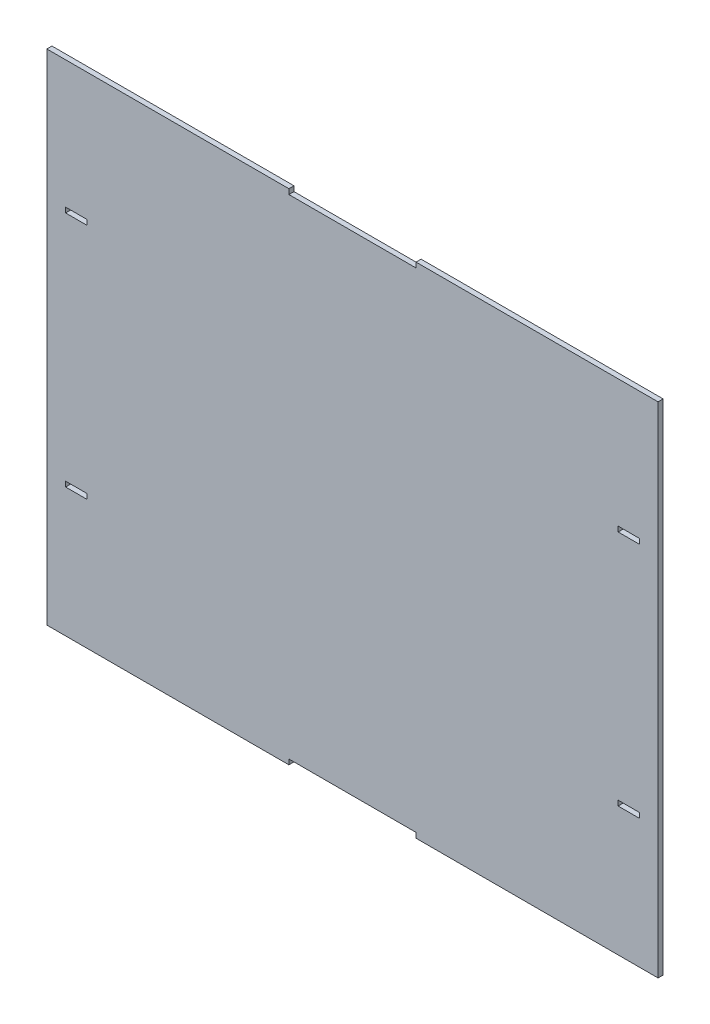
ISO-10303-21;
HEADER;
FILE_DESCRIPTION(('STEP AP214'),'2;1');
FILE_NAME('part.step','',(''),(''),'','','');
FILE_SCHEMA(('AUTOMOTIVE_DESIGN { 1 0 10303 214 1 1 1 1 }'));
ENDSEC;
DATA;
#1=APPLICATION_CONTEXT('core data for automotive mechanical design processes');
#2=APPLICATION_PROTOCOL_DEFINITION('international standard','automotive_design',2000,#1);
#3=PRODUCT_CONTEXT('',#1,'mechanical');
#4=PRODUCT('Part','Part','',(#3));
#5=PRODUCT_RELATED_PRODUCT_CATEGORY('part','',(#4));
#6=PRODUCT_DEFINITION_FORMATION('','',#4);
#7=PRODUCT_DEFINITION_CONTEXT('part definition',#1,'design');
#8=PRODUCT_DEFINITION('design','',#6,#7);
#9=PRODUCT_DEFINITION_SHAPE('','',#8);
#10=(LENGTH_UNIT() NAMED_UNIT(*) SI_UNIT(.MILLI.,.METRE.));
#11=(NAMED_UNIT(*) PLANE_ANGLE_UNIT() SI_UNIT($,.RADIAN.));
#12=(NAMED_UNIT(*) SI_UNIT($,.STERADIAN.) SOLID_ANGLE_UNIT());
#13=UNCERTAINTY_MEASURE_WITH_UNIT(LENGTH_MEASURE(1.E-05),#10,'distance_accuracy_value','');
#14=(GEOMETRIC_REPRESENTATION_CONTEXT(3) GLOBAL_UNCERTAINTY_ASSIGNED_CONTEXT((#13)) GLOBAL_UNIT_ASSIGNED_CONTEXT((#10,
#11,#12)) REPRESENTATION_CONTEXT('',''));
#15=CARTESIAN_POINT('',(0.,0.,0.));
#16=DIRECTION('',(0.,0.,1.));
#17=DIRECTION('',(1.,0.,0.));
#18=AXIS2_PLACEMENT_3D('',#15,#16,#17);
#19=CARTESIAN_POINT('',(0.,0.,1.524));
#20=DIRECTION('',(0.,0.,-1.));
#21=DIRECTION('',(-1.,0.,0.));
#22=AXIS2_PLACEMENT_3D('',#19,#20,#21);
#23=PLANE('',#22);
#24=DIRECTION('',(0.,1.,0.));
#25=VECTOR('',#24,1.);
#26=CARTESIAN_POINT('',(313.093489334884,-38.2599531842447,1.524));
#27=LINE('',#26,#25);
#28=CARTESIAN_POINT('',(313.093489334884,-39.7839531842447,1.524));
#29=VERTEX_POINT('',#28);
#30=CARTESIAN_POINT('',(313.093489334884,-38.2599531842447,1.524));
#31=VERTEX_POINT('',#30);
#32=EDGE_CURVE('E255',#29,#31,#27,.T.);
#33=ORIENTED_EDGE('',*,*,#32,.F.);
#34=DIRECTION('',(1.,0.,0.));
#35=VECTOR('',#34,1.);
#36=CARTESIAN_POINT('',(313.093489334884,-39.7839531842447,1.524));
#37=LINE('',#36,#35);
#38=CARTESIAN_POINT('',(306.743489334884,-39.7839531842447,1.524));
#39=VERTEX_POINT('',#38);
#40=EDGE_CURVE('E263',#39,#29,#37,.T.);
#41=ORIENTED_EDGE('',*,*,#40,.F.);
#42=DIRECTION('',(0.,-1.,0.));
#43=VECTOR('',#42,1.);
#44=CARTESIAN_POINT('',(306.743489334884,-38.2599531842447,1.524));
#45=LINE('',#44,#43);
#46=CARTESIAN_POINT('',(306.743489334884,-38.2599531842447,1.524));
#47=VERTEX_POINT('',#46);
#48=EDGE_CURVE('E260',#47,#39,#45,.T.);
#49=ORIENTED_EDGE('',*,*,#48,.F.);
#50=DIRECTION('',(-1.,0.,0.));
#51=VECTOR('',#50,1.);
#52=CARTESIAN_POINT('',(313.093489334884,-38.2599531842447,1.524));
#53=LINE('',#52,#51);
#54=EDGE_CURVE('E257',#31,#47,#53,.T.);
#55=ORIENTED_EDGE('',*,*,#54,.F.);
#56=EDGE_LOOP('',(#33,#41,#49,#55));
#57=FACE_BOUND('',#56,.T.);
#58=DIRECTION('',(0.,1.,0.));
#59=VECTOR('',#58,1.);
#60=CARTESIAN_POINT('',(147.408510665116,-110.953560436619,1.524));
#61=LINE('',#60,#59);
#62=CARTESIAN_POINT('',(147.408510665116,-110.953560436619,1.524));
#63=VERTEX_POINT('',#62);
#64=CARTESIAN_POINT('',(147.408510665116,-109.429560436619,1.524));
#65=VERTEX_POINT('',#64);
#66=EDGE_CURVE('E317',#63,#65,#61,.T.);
#67=ORIENTED_EDGE('',*,*,#66,.F.);
#68=DIRECTION('',(1.,0.,0.));
#69=VECTOR('',#68,1.);
#70=CARTESIAN_POINT('',(147.408510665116,-110.953560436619,1.524));
#71=LINE('',#70,#69);
#72=CARTESIAN_POINT('',(141.058510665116,-110.953560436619,1.524));
#73=VERTEX_POINT('',#72);
#74=EDGE_CURVE('E325',#73,#63,#71,.T.);
#75=ORIENTED_EDGE('',*,*,#74,.F.);
#76=DIRECTION('',(0.,-1.,0.));
#77=VECTOR('',#76,1.);
#78=CARTESIAN_POINT('',(141.058510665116,-110.953560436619,1.524));
#79=LINE('',#78,#77);
#80=CARTESIAN_POINT('',(141.058510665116,-109.429560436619,1.524));
#81=VERTEX_POINT('',#80);
#82=EDGE_CURVE('E322',#81,#73,#79,.T.);
#83=ORIENTED_EDGE('',*,*,#82,.F.);
#84=DIRECTION('',(-1.,0.,0.));
#85=VECTOR('',#84,1.);
#86=CARTESIAN_POINT('',(147.408510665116,-109.429560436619,1.524));
#87=LINE('',#86,#85);
#88=EDGE_CURVE('E319',#65,#81,#87,.T.);
#89=ORIENTED_EDGE('',*,*,#88,.F.);
#90=EDGE_LOOP('',(#67,#75,#83,#89));
#91=FACE_BOUND('',#90,.T.);
#92=DIRECTION('',(0.,1.,0.));
#93=VECTOR('',#92,1.);
#94=CARTESIAN_POINT('',(318.720585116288,0.,1.524));
#95=LINE('',#94,#93);
#96=CARTESIAN_POINT('',(318.720585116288,-149.623378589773,1.524));
#97=VERTEX_POINT('',#96);
#98=CARTESIAN_POINT('',(318.720585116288,0.,1.524));
#99=VERTEX_POINT('',#98);
#100=EDGE_CURVE('E348',#97,#99,#95,.T.);
#101=ORIENTED_EDGE('',*,*,#100,.T.);
#102=DIRECTION('',(-1.,0.,0.));
#103=VECTOR('',#102,1.);
#104=CARTESIAN_POINT('',(318.720585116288,0.,1.524));
#105=LINE('',#104,#103);
#106=CARTESIAN_POINT('',(246.126,0.,1.524));
#107=VERTEX_POINT('',#106);
#108=EDGE_CURVE('E351',#99,#107,#105,.T.);
#109=ORIENTED_EDGE('',*,*,#108,.T.);
#110=DIRECTION('',(0.,-1.,0.));
#111=VECTOR('',#110,1.);
#112=CARTESIAN_POINT('',(246.126,-1.524,1.524));
#113=LINE('',#112,#111);
#114=CARTESIAN_POINT('',(246.126,-1.524,1.524));
#115=VERTEX_POINT('',#114);
#116=EDGE_CURVE('E354',#107,#115,#113,.T.);
#117=ORIENTED_EDGE('',*,*,#116,.T.);
#118=DIRECTION('',(-1.,0.,0.));
#119=VECTOR('',#118,1.);
#120=CARTESIAN_POINT('',(246.126,-1.524,1.524));
#121=LINE('',#120,#119);
#122=CARTESIAN_POINT('',(208.026,-1.524,1.524));
#123=VERTEX_POINT('',#122);
#124=EDGE_CURVE('E356',#115,#123,#121,.T.);
#125=ORIENTED_EDGE('',*,*,#124,.T.);
#126=DIRECTION('',(0.,1.,0.));
#127=VECTOR('',#126,1.);
#128=CARTESIAN_POINT('',(208.026,-1.524,1.524));
#129=LINE('',#128,#127);
#130=CARTESIAN_POINT('',(208.026,0.,1.524));
#131=VERTEX_POINT('',#130);
#132=EDGE_CURVE('E358',#123,#131,#129,.T.);
#133=ORIENTED_EDGE('',*,*,#132,.T.);
#134=DIRECTION('',(-1.,0.,0.));
#135=VECTOR('',#134,1.);
#136=CARTESIAN_POINT('',(208.026,0.,1.524));
#137=LINE('',#136,#135);
#138=CARTESIAN_POINT('',(135.431414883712,0.,1.524));
#139=VERTEX_POINT('',#138);
#140=EDGE_CURVE('E360',#131,#139,#137,.T.);
#141=ORIENTED_EDGE('',*,*,#140,.T.);
#142=DIRECTION('',(0.,-1.,0.));
#143=VECTOR('',#142,1.);
#144=CARTESIAN_POINT('',(135.431414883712,0.,1.524));
#145=LINE('',#144,#143);
#146=CARTESIAN_POINT('',(135.431414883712,-149.623378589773,1.524));
#147=VERTEX_POINT('',#146);
#148=EDGE_CURVE('E362',#139,#147,#145,.T.);
#149=ORIENTED_EDGE('',*,*,#148,.T.);
#150=DIRECTION('',(1.,0.,0.));
#151=VECTOR('',#150,1.);
#152=CARTESIAN_POINT('',(208.026,-149.623378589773,1.524));
#153=LINE('',#152,#151);
#154=CARTESIAN_POINT('',(208.026,-149.623378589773,1.524));
#155=VERTEX_POINT('',#154);
#156=EDGE_CURVE('E364',#147,#155,#153,.T.);
#157=ORIENTED_EDGE('',*,*,#156,.T.);
#158=DIRECTION('',(0.,1.,0.));
#159=VECTOR('',#158,1.);
#160=CARTESIAN_POINT('',(208.026,-148.099378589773,1.524));
#161=LINE('',#160,#159);
#162=CARTESIAN_POINT('',(208.026,-148.099378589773,1.524));
#163=VERTEX_POINT('',#162);
#164=EDGE_CURVE('E366',#155,#163,#161,.T.);
#165=ORIENTED_EDGE('',*,*,#164,.T.);
#166=DIRECTION('',(1.,0.,0.));
#167=VECTOR('',#166,1.);
#168=CARTESIAN_POINT('',(208.026,-148.099378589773,1.524));
#169=LINE('',#168,#167);
#170=CARTESIAN_POINT('',(246.126,-148.099378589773,1.524));
#171=VERTEX_POINT('',#170);
#172=EDGE_CURVE('E368',#163,#171,#169,.T.);
#173=ORIENTED_EDGE('',*,*,#172,.T.);
#174=DIRECTION('',(0.,-1.,0.));
#175=VECTOR('',#174,1.);
#176=CARTESIAN_POINT('',(246.126,-148.099378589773,1.524));
#177=LINE('',#176,#175);
#178=CARTESIAN_POINT('',(246.126,-149.623378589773,1.524));
#179=VERTEX_POINT('',#178);
#180=EDGE_CURVE('E370',#171,#179,#177,.T.);
#181=ORIENTED_EDGE('',*,*,#180,.T.);
#182=DIRECTION('',(1.,0.,0.));
#183=VECTOR('',#182,1.);
#184=CARTESIAN_POINT('',(318.720585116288,-149.623378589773,1.524));
#185=LINE('',#184,#183);
#186=EDGE_CURVE('E372',#179,#97,#185,.T.);
#187=ORIENTED_EDGE('',*,*,#186,.T.);
#188=EDGE_LOOP('',(#101,#109,#117,#125,#133,#141,#149,#157,#165,#173,#181,#187));
#189=FACE_BOUND('',#188,.T.);
#190=DIRECTION('',(0.,1.,0.));
#191=VECTOR('',#190,1.);
#192=CARTESIAN_POINT('',(147.408510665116,-39.7839531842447,1.524));
#193=LINE('',#192,#191);
#194=CARTESIAN_POINT('',(147.408510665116,-39.7839531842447,1.524));
#195=VERTEX_POINT('',#194);
#196=CARTESIAN_POINT('',(147.408510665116,-38.2599531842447,1.524));
#197=VERTEX_POINT('',#196);
#198=EDGE_CURVE('E286',#195,#197,#193,.T.);
#199=ORIENTED_EDGE('',*,*,#198,.F.);
#200=DIRECTION('',(1.,0.,0.));
#201=VECTOR('',#200,1.);
#202=CARTESIAN_POINT('',(147.408510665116,-39.7839531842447,1.524));
#203=LINE('',#202,#201);
#204=CARTESIAN_POINT('',(141.058510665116,-39.7839531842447,1.524));
#205=VERTEX_POINT('',#204);
#206=EDGE_CURVE('E294',#205,#195,#203,.T.);
#207=ORIENTED_EDGE('',*,*,#206,.F.);
#208=DIRECTION('',(0.,-1.,0.));
#209=VECTOR('',#208,1.);
#210=CARTESIAN_POINT('',(141.058510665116,-39.7839531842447,1.524));
#211=LINE('',#210,#209);
#212=CARTESIAN_POINT('',(141.058510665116,-38.2599531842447,1.524));
#213=VERTEX_POINT('',#212);
#214=EDGE_CURVE('E291',#213,#205,#211,.T.);
#215=ORIENTED_EDGE('',*,*,#214,.F.);
#216=DIRECTION('',(-1.,0.,0.));
#217=VECTOR('',#216,1.);
#218=CARTESIAN_POINT('',(147.408510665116,-38.2599531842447,1.524));
#219=LINE('',#218,#217);
#220=EDGE_CURVE('E288',#197,#213,#219,.T.);
#221=ORIENTED_EDGE('',*,*,#220,.F.);
#222=EDGE_LOOP('',(#199,#207,#215,#221));
#223=FACE_BOUND('',#222,.T.);
#224=DIRECTION('',(0.,1.,0.));
#225=VECTOR('',#224,1.);
#226=CARTESIAN_POINT('',(313.093489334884,-109.429560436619,1.524));
#227=LINE('',#226,#225);
#228=CARTESIAN_POINT('',(313.093489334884,-110.953560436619,1.524));
#229=VERTEX_POINT('',#228);
#230=CARTESIAN_POINT('',(313.093489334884,-109.429560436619,1.524));
#231=VERTEX_POINT('',#230);
#232=EDGE_CURVE('E219',#229,#231,#227,.T.);
#233=ORIENTED_EDGE('',*,*,#232,.F.);
#234=DIRECTION('',(1.,0.,0.));
#235=VECTOR('',#234,1.);
#236=CARTESIAN_POINT('',(313.093489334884,-110.953560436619,1.524));
#237=LINE('',#236,#235);
#238=CARTESIAN_POINT('',(306.743489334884,-110.953560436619,1.524));
#239=VERTEX_POINT('',#238);
#240=EDGE_CURVE('E241',#239,#229,#237,.T.);
#241=ORIENTED_EDGE('',*,*,#240,.F.);
#242=DIRECTION('',(0.,-1.,0.));
#243=VECTOR('',#242,1.);
#244=CARTESIAN_POINT('',(306.743489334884,-109.429560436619,1.524));
#245=LINE('',#244,#243);
#246=CARTESIAN_POINT('',(306.743489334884,-109.429560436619,1.524));
#247=VERTEX_POINT('',#246);
#248=EDGE_CURVE('E239',#247,#239,#245,.T.);
#249=ORIENTED_EDGE('',*,*,#248,.F.);
#250=DIRECTION('',(-1.,0.,0.));
#251=VECTOR('',#250,1.);
#252=CARTESIAN_POINT('',(313.093489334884,-109.429560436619,1.524));
#253=LINE('',#252,#251);
#254=EDGE_CURVE('E227',#231,#247,#253,.T.);
#255=ORIENTED_EDGE('',*,*,#254,.F.);
#256=EDGE_LOOP('',(#233,#241,#249,#255));
#257=FACE_BOUND('',#256,.T.);
#258=ADVANCED_FACE('F34',(#57,#91,#189,#223,#257),#23,.F.);
#259=CARTESIAN_POINT('',(0.,0.,0.));
#260=DIRECTION('',(0.,0.,-1.));
#261=DIRECTION('',(-1.,0.,0.));
#262=AXIS2_PLACEMENT_3D('',#259,#260,#261);
#263=PLANE('',#262);
#264=DIRECTION('',(1.,0.,0.));
#265=VECTOR('',#264,1.);
#266=CARTESIAN_POINT('',(313.093489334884,-39.7839531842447,0.));
#267=LINE('',#266,#265);
#268=CARTESIAN_POINT('',(306.743489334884,-39.7839531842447,0.));
#269=VERTEX_POINT('',#268);
#270=CARTESIAN_POINT('',(313.093489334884,-39.7839531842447,0.));
#271=VERTEX_POINT('',#270);
#272=EDGE_CURVE('E258',#269,#271,#267,.T.);
#273=ORIENTED_EDGE('',*,*,#272,.T.);
#274=DIRECTION('',(0.,1.,0.));
#275=VECTOR('',#274,1.);
#276=CARTESIAN_POINT('',(313.093489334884,-38.2599531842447,0.));
#277=LINE('',#276,#275);
#278=CARTESIAN_POINT('',(313.093489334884,-38.2599531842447,0.));
#279=VERTEX_POINT('',#278);
#280=EDGE_CURVE('E235',#271,#279,#277,.T.);
#281=ORIENTED_EDGE('',*,*,#280,.T.);
#282=DIRECTION('',(-1.,0.,0.));
#283=VECTOR('',#282,1.);
#284=CARTESIAN_POINT('',(313.093489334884,-38.2599531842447,0.));
#285=LINE('',#284,#283);
#286=CARTESIAN_POINT('',(306.743489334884,-38.2599531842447,0.));
#287=VERTEX_POINT('',#286);
#288=EDGE_CURVE('E268',#279,#287,#285,.T.);
#289=ORIENTED_EDGE('',*,*,#288,.T.);
#290=DIRECTION('',(0.,-1.,0.));
#291=VECTOR('',#290,1.);
#292=CARTESIAN_POINT('',(306.743489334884,-38.2599531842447,0.));
#293=LINE('',#292,#291);
#294=EDGE_CURVE('E271',#287,#269,#293,.T.);
#295=ORIENTED_EDGE('',*,*,#294,.T.);
#296=EDGE_LOOP('',(#273,#281,#289,#295));
#297=FACE_BOUND('',#296,.T.);
#298=DIRECTION('',(1.,0.,0.));
#299=VECTOR('',#298,1.);
#300=CARTESIAN_POINT('',(147.408510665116,-110.953560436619,0.));
#301=LINE('',#300,#299);
#302=CARTESIAN_POINT('',(141.058510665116,-110.953560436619,0.));
#303=VERTEX_POINT('',#302);
#304=CARTESIAN_POINT('',(147.408510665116,-110.953560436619,0.));
#305=VERTEX_POINT('',#304);
#306=EDGE_CURVE('E320',#303,#305,#301,.T.);
#307=ORIENTED_EDGE('',*,*,#306,.T.);
#308=DIRECTION('',(0.,1.,0.));
#309=VECTOR('',#308,1.);
#310=CARTESIAN_POINT('',(147.408510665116,-110.953560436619,0.));
#311=LINE('',#310,#309);
#312=CARTESIAN_POINT('',(147.408510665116,-109.429560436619,0.));
#313=VERTEX_POINT('',#312);
#314=EDGE_CURVE('E316',#305,#313,#311,.T.);
#315=ORIENTED_EDGE('',*,*,#314,.T.);
#316=DIRECTION('',(-1.,0.,0.));
#317=VECTOR('',#316,1.);
#318=CARTESIAN_POINT('',(147.408510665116,-109.429560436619,0.));
#319=LINE('',#318,#317);
#320=CARTESIAN_POINT('',(141.058510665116,-109.429560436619,0.));
#321=VERTEX_POINT('',#320);
#322=EDGE_CURVE('E330',#313,#321,#319,.T.);
#323=ORIENTED_EDGE('',*,*,#322,.T.);
#324=DIRECTION('',(0.,-1.,0.));
#325=VECTOR('',#324,1.);
#326=CARTESIAN_POINT('',(141.058510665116,-110.953560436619,0.));
#327=LINE('',#326,#325);
#328=EDGE_CURVE('E333',#321,#303,#327,.T.);
#329=ORIENTED_EDGE('',*,*,#328,.T.);
#330=EDGE_LOOP('',(#307,#315,#323,#329));
#331=FACE_BOUND('',#330,.T.);
#332=DIRECTION('',(0.,1.,0.));
#333=VECTOR('',#332,1.);
#334=CARTESIAN_POINT('',(318.720585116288,0.,0.));
#335=LINE('',#334,#333);
#336=CARTESIAN_POINT('',(318.720585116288,-149.623378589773,0.));
#337=VERTEX_POINT('',#336);
#338=CARTESIAN_POINT('',(318.720585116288,0.,0.));
#339=VERTEX_POINT('',#338);
#340=EDGE_CURVE('E347',#337,#339,#335,.T.);
#341=ORIENTED_EDGE('',*,*,#340,.F.);
#342=DIRECTION('',(1.,0.,0.));
#343=VECTOR('',#342,1.);
#344=CARTESIAN_POINT('',(318.720585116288,-149.623378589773,0.));
#345=LINE('',#344,#343);
#346=CARTESIAN_POINT('',(246.126,-149.623378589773,0.));
#347=VERTEX_POINT('',#346);
#348=EDGE_CURVE('E352',#347,#337,#345,.T.);
#349=ORIENTED_EDGE('',*,*,#348,.F.);
#350=DIRECTION('',(0.,-1.,0.));
#351=VECTOR('',#350,1.);
#352=CARTESIAN_POINT('',(246.126,-148.099378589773,0.));
#353=LINE('',#352,#351);
#354=CARTESIAN_POINT('',(246.126,-148.099378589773,0.));
#355=VERTEX_POINT('',#354);
#356=EDGE_CURVE('E395',#355,#347,#353,.T.);
#357=ORIENTED_EDGE('',*,*,#356,.F.);
#358=DIRECTION('',(1.,0.,0.));
#359=VECTOR('',#358,1.);
#360=CARTESIAN_POINT('',(208.026,-148.099378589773,0.));
#361=LINE('',#360,#359);
#362=CARTESIAN_POINT('',(208.026,-148.099378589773,0.));
#363=VERTEX_POINT('',#362);
#364=EDGE_CURVE('E393',#363,#355,#361,.T.);
#365=ORIENTED_EDGE('',*,*,#364,.F.);
#366=DIRECTION('',(0.,1.,0.));
#367=VECTOR('',#366,1.);
#368=CARTESIAN_POINT('',(208.026,-148.099378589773,0.));
#369=LINE('',#368,#367);
#370=CARTESIAN_POINT('',(208.026,-149.623378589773,0.));
#371=VERTEX_POINT('',#370);
#372=EDGE_CURVE('E391',#371,#363,#369,.T.);
#373=ORIENTED_EDGE('',*,*,#372,.F.);
#374=DIRECTION('',(1.,0.,0.));
#375=VECTOR('',#374,1.);
#376=CARTESIAN_POINT('',(208.026,-149.623378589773,0.));
#377=LINE('',#376,#375);
#378=CARTESIAN_POINT('',(135.431414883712,-149.623378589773,0.));
#379=VERTEX_POINT('',#378);
#380=EDGE_CURVE('E389',#379,#371,#377,.T.);
#381=ORIENTED_EDGE('',*,*,#380,.F.);
#382=DIRECTION('',(0.,-1.,0.));
#383=VECTOR('',#382,1.);
#384=CARTESIAN_POINT('',(135.431414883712,0.,0.));
#385=LINE('',#384,#383);
#386=CARTESIAN_POINT('',(135.431414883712,0.,0.));
#387=VERTEX_POINT('',#386);
#388=EDGE_CURVE('E387',#387,#379,#385,.T.);
#389=ORIENTED_EDGE('',*,*,#388,.F.);
#390=DIRECTION('',(-1.,0.,0.));
#391=VECTOR('',#390,1.);
#392=CARTESIAN_POINT('',(208.026,0.,0.));
#393=LINE('',#392,#391);
#394=CARTESIAN_POINT('',(208.026,0.,0.));
#395=VERTEX_POINT('',#394);
#396=EDGE_CURVE('E385',#395,#387,#393,.T.);
#397=ORIENTED_EDGE('',*,*,#396,.F.);
#398=DIRECTION('',(0.,1.,0.));
#399=VECTOR('',#398,1.);
#400=CARTESIAN_POINT('',(208.026,-1.524,0.));
#401=LINE('',#400,#399);
#402=CARTESIAN_POINT('',(208.026,-1.524,0.));
#403=VERTEX_POINT('',#402);
#404=EDGE_CURVE('E383',#403,#395,#401,.T.);
#405=ORIENTED_EDGE('',*,*,#404,.F.);
#406=DIRECTION('',(-1.,0.,0.));
#407=VECTOR('',#406,1.);
#408=CARTESIAN_POINT('',(246.126,-1.524,0.));
#409=LINE('',#408,#407);
#410=CARTESIAN_POINT('',(246.126,-1.524,0.));
#411=VERTEX_POINT('',#410);
#412=EDGE_CURVE('E381',#411,#403,#409,.T.);
#413=ORIENTED_EDGE('',*,*,#412,.F.);
#414=DIRECTION('',(0.,-1.,0.));
#415=VECTOR('',#414,1.);
#416=CARTESIAN_POINT('',(246.126,-1.524,0.));
#417=LINE('',#416,#415);
#418=CARTESIAN_POINT('',(246.126,0.,0.));
#419=VERTEX_POINT('',#418);
#420=EDGE_CURVE('E379',#419,#411,#417,.T.);
#421=ORIENTED_EDGE('',*,*,#420,.F.);
#422=DIRECTION('',(-1.,0.,0.));
#423=VECTOR('',#422,1.);
#424=CARTESIAN_POINT('',(318.720585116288,0.,0.));
#425=LINE('',#424,#423);
#426=EDGE_CURVE('E377',#339,#419,#425,.T.);
#427=ORIENTED_EDGE('',*,*,#426,.F.);
#428=EDGE_LOOP('',(#341,#349,#357,#365,#373,#381,#389,#397,#405,#413,#421,#427));
#429=FACE_BOUND('',#428,.T.);
#430=DIRECTION('',(1.,0.,0.));
#431=VECTOR('',#430,1.);
#432=CARTESIAN_POINT('',(147.408510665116,-39.7839531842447,0.));
#433=LINE('',#432,#431);
#434=CARTESIAN_POINT('',(141.058510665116,-39.7839531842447,0.));
#435=VERTEX_POINT('',#434);
#436=CARTESIAN_POINT('',(147.408510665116,-39.7839531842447,0.));
#437=VERTEX_POINT('',#436);
#438=EDGE_CURVE('E289',#435,#437,#433,.T.);
#439=ORIENTED_EDGE('',*,*,#438,.T.);
#440=DIRECTION('',(0.,1.,0.));
#441=VECTOR('',#440,1.);
#442=CARTESIAN_POINT('',(147.408510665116,-39.7839531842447,0.));
#443=LINE('',#442,#441);
#444=CARTESIAN_POINT('',(147.408510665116,-38.2599531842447,0.));
#445=VERTEX_POINT('',#444);
#446=EDGE_CURVE('E285',#437,#445,#443,.T.);
#447=ORIENTED_EDGE('',*,*,#446,.T.);
#448=DIRECTION('',(-1.,0.,0.));
#449=VECTOR('',#448,1.);
#450=CARTESIAN_POINT('',(147.408510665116,-38.2599531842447,0.));
#451=LINE('',#450,#449);
#452=CARTESIAN_POINT('',(141.058510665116,-38.2599531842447,0.));
#453=VERTEX_POINT('',#452);
#454=EDGE_CURVE('E299',#445,#453,#451,.T.);
#455=ORIENTED_EDGE('',*,*,#454,.T.);
#456=DIRECTION('',(0.,-1.,0.));
#457=VECTOR('',#456,1.);
#458=CARTESIAN_POINT('',(141.058510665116,-39.7839531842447,0.));
#459=LINE('',#458,#457);
#460=EDGE_CURVE('E302',#453,#435,#459,.T.);
#461=ORIENTED_EDGE('',*,*,#460,.T.);
#462=EDGE_LOOP('',(#439,#447,#455,#461));
#463=FACE_BOUND('',#462,.T.);
#464=DIRECTION('',(1.,0.,0.));
#465=VECTOR('',#464,1.);
#466=CARTESIAN_POINT('',(313.093489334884,-110.953560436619,0.));
#467=LINE('',#466,#465);
#468=CARTESIAN_POINT('',(306.743489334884,-110.953560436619,0.));
#469=VERTEX_POINT('',#468);
#470=CARTESIAN_POINT('',(313.093489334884,-110.953560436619,0.));
#471=VERTEX_POINT('',#470);
#472=EDGE_CURVE('E228',#469,#471,#467,.T.);
#473=ORIENTED_EDGE('',*,*,#472,.T.);
#474=DIRECTION('',(0.,1.,0.));
#475=VECTOR('',#474,1.);
#476=CARTESIAN_POINT('',(313.093489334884,-109.429560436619,0.));
#477=LINE('',#476,#475);
#478=CARTESIAN_POINT('',(313.093489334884,-109.429560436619,0.));
#479=VERTEX_POINT('',#478);
#480=EDGE_CURVE('E57',#471,#479,#477,.T.);
#481=ORIENTED_EDGE('',*,*,#480,.T.);
#482=DIRECTION('',(-1.,0.,0.));
#483=VECTOR('',#482,1.);
#484=CARTESIAN_POINT('',(313.093489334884,-109.429560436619,0.));
#485=LINE('',#484,#483);
#486=CARTESIAN_POINT('',(306.743489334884,-109.429560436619,0.));
#487=VERTEX_POINT('',#486);
#488=EDGE_CURVE('E234',#479,#487,#485,.T.);
#489=ORIENTED_EDGE('',*,*,#488,.T.);
#490=DIRECTION('',(0.,-1.,0.));
#491=VECTOR('',#490,1.);
#492=CARTESIAN_POINT('',(306.743489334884,-109.429560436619,0.));
#493=LINE('',#492,#491);
#494=EDGE_CURVE('E247',#487,#469,#493,.T.);
#495=ORIENTED_EDGE('',*,*,#494,.T.);
#496=EDGE_LOOP('',(#473,#481,#489,#495));
#497=FACE_BOUND('',#496,.T.);
#498=ADVANCED_FACE('F437',(#297,#331,#429,#463,#497),#263,.T.);
#499=CARTESIAN_POINT('',(318.720585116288,0.,1.524));
#500=DIRECTION('',(-1.,0.,0.));
#501=DIRECTION('',(0.,0.,1.));
#502=AXIS2_PLACEMENT_3D('',#499,#500,#501);
#503=PLANE('',#502);
#504=ORIENTED_EDGE('',*,*,#340,.T.);
#505=DIRECTION('',(0.,0.,-1.));
#506=VECTOR('',#505,1.);
#507=CARTESIAN_POINT('',(318.720585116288,0.,1.524));
#508=LINE('',#507,#506);
#509=EDGE_CURVE('E11',#99,#339,#508,.T.);
#510=ORIENTED_EDGE('',*,*,#509,.F.);
#511=ORIENTED_EDGE('',*,*,#100,.F.);
#512=DIRECTION('',(0.,0.,-1.));
#513=VECTOR('',#512,1.);
#514=CARTESIAN_POINT('',(318.720585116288,-149.623378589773,1.524));
#515=LINE('',#514,#513);
#516=EDGE_CURVE('E374',#97,#337,#515,.T.);
#517=ORIENTED_EDGE('',*,*,#516,.T.);
#518=EDGE_LOOP('',(#504,#510,#511,#517));
#519=FACE_BOUND('',#518,.T.);
#520=ADVANCED_FACE('F36',(#519),#503,.F.);
#521=CARTESIAN_POINT('',(318.720585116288,0.,1.524));
#522=DIRECTION('',(0.,-1.,0.));
#523=DIRECTION('',(0.,0.,-1.));
#524=AXIS2_PLACEMENT_3D('',#521,#522,#523);
#525=PLANE('',#524);
#526=ORIENTED_EDGE('',*,*,#426,.T.);
#527=DIRECTION('',(0.,0.,-1.));
#528=VECTOR('',#527,1.);
#529=CARTESIAN_POINT('',(246.126,0.,1.524));
#530=LINE('',#529,#528);
#531=EDGE_CURVE('E42',#107,#419,#530,.T.);
#532=ORIENTED_EDGE('',*,*,#531,.F.);
#533=ORIENTED_EDGE('',*,*,#108,.F.);
#534=ORIENTED_EDGE('',*,*,#509,.T.);
#535=EDGE_LOOP('',(#526,#532,#533,#534));
#536=FACE_BOUND('',#535,.T.);
#537=ADVANCED_FACE('F455',(#536),#525,.F.);
#538=CARTESIAN_POINT('',(246.126,-1.524,1.524));
#539=DIRECTION('',(1.,0.,0.));
#540=DIRECTION('',(0.,0.,-1.));
#541=AXIS2_PLACEMENT_3D('',#538,#539,#540);
#542=PLANE('',#541);
#543=ORIENTED_EDGE('',*,*,#420,.T.);
#544=DIRECTION('',(0.,0.,-1.));
#545=VECTOR('',#544,1.);
#546=CARTESIAN_POINT('',(246.126,-1.524,1.524));
#547=LINE('',#546,#545);
#548=EDGE_CURVE('E424',#115,#411,#547,.T.);
#549=ORIENTED_EDGE('',*,*,#548,.F.);
#550=ORIENTED_EDGE('',*,*,#116,.F.);
#551=ORIENTED_EDGE('',*,*,#531,.T.);
#552=EDGE_LOOP('',(#543,#549,#550,#551));
#553=FACE_BOUND('',#552,.T.);
#554=ADVANCED_FACE('F431',(#553),#542,.F.);
#555=CARTESIAN_POINT('',(246.126,-1.524,1.524));
#556=DIRECTION('',(0.,-1.,0.));
#557=DIRECTION('',(0.,0.,-1.));
#558=AXIS2_PLACEMENT_3D('',#555,#556,#557);
#559=PLANE('',#558);
#560=ORIENTED_EDGE('',*,*,#412,.T.);
#561=DIRECTION('',(0.,0.,-1.));
#562=VECTOR('',#561,1.);
#563=CARTESIAN_POINT('',(208.026,-1.524,1.524));
#564=LINE('',#563,#562);
#565=EDGE_CURVE('E421',#123,#403,#564,.T.);
#566=ORIENTED_EDGE('',*,*,#565,.F.);
#567=ORIENTED_EDGE('',*,*,#124,.F.);
#568=ORIENTED_EDGE('',*,*,#548,.T.);
#569=EDGE_LOOP('',(#560,#566,#567,#568));
#570=FACE_BOUND('',#569,.T.);
#571=ADVANCED_FACE('F443',(#570),#559,.F.);
#572=CARTESIAN_POINT('',(208.026,-1.524,1.524));
#573=DIRECTION('',(-1.,0.,0.));
#574=DIRECTION('',(0.,0.,1.));
#575=AXIS2_PLACEMENT_3D('',#572,#573,#574);
#576=PLANE('',#575);
#577=ORIENTED_EDGE('',*,*,#404,.T.);
#578=DIRECTION('',(0.,0.,-1.));
#579=VECTOR('',#578,1.);
#580=CARTESIAN_POINT('',(208.026,0.,1.524));
#581=LINE('',#580,#579);
#582=EDGE_CURVE('E418',#131,#395,#581,.T.);
#583=ORIENTED_EDGE('',*,*,#582,.F.);
#584=ORIENTED_EDGE('',*,*,#132,.F.);
#585=ORIENTED_EDGE('',*,*,#565,.T.);
#586=EDGE_LOOP('',(#577,#583,#584,#585));
#587=FACE_BOUND('',#586,.T.);
#588=ADVANCED_FACE('F447',(#587),#576,.F.);
#589=CARTESIAN_POINT('',(208.026,0.,1.524));
#590=DIRECTION('',(0.,-1.,0.));
#591=DIRECTION('',(0.,0.,-1.));
#592=AXIS2_PLACEMENT_3D('',#589,#590,#591);
#593=PLANE('',#592);
#594=ORIENTED_EDGE('',*,*,#396,.T.);
#595=DIRECTION('',(0.,0.,-1.));
#596=VECTOR('',#595,1.);
#597=CARTESIAN_POINT('',(135.431414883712,0.,1.524));
#598=LINE('',#597,#596);
#599=EDGE_CURVE('E415',#139,#387,#598,.T.);
#600=ORIENTED_EDGE('',*,*,#599,.F.);
#601=ORIENTED_EDGE('',*,*,#140,.F.);
#602=ORIENTED_EDGE('',*,*,#582,.T.);
#603=EDGE_LOOP('',(#594,#600,#601,#602));
#604=FACE_BOUND('',#603,.T.);
#605=ADVANCED_FACE('F488',(#604),#593,.F.);
#606=CARTESIAN_POINT('',(135.431414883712,0.,1.524));
#607=DIRECTION('',(1.,0.,0.));
#608=DIRECTION('',(0.,0.,-1.));
#609=AXIS2_PLACEMENT_3D('',#606,#607,#608);
#610=PLANE('',#609);
#611=ORIENTED_EDGE('',*,*,#388,.T.);
#612=DIRECTION('',(0.,0.,-1.));
#613=VECTOR('',#612,1.);
#614=CARTESIAN_POINT('',(135.431414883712,-149.623378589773,1.524));
#615=LINE('',#614,#613);
#616=EDGE_CURVE('E412',#147,#379,#615,.T.);
#617=ORIENTED_EDGE('',*,*,#616,.F.);
#618=ORIENTED_EDGE('',*,*,#148,.F.);
#619=ORIENTED_EDGE('',*,*,#599,.T.);
#620=EDGE_LOOP('',(#611,#617,#618,#619));
#621=FACE_BOUND('',#620,.T.);
#622=ADVANCED_FACE('F486',(#621),#610,.F.);
#623=CARTESIAN_POINT('',(208.026,-149.623378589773,1.524));
#624=DIRECTION('',(0.,1.,0.));
#625=DIRECTION('',(0.,0.,1.));
#626=AXIS2_PLACEMENT_3D('',#623,#624,#625);
#627=PLANE('',#626);
#628=ORIENTED_EDGE('',*,*,#380,.T.);
#629=DIRECTION('',(0.,0.,-1.));
#630=VECTOR('',#629,1.);
#631=CARTESIAN_POINT('',(208.026,-149.623378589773,1.524));
#632=LINE('',#631,#630);
#633=EDGE_CURVE('E409',#155,#371,#632,.T.);
#634=ORIENTED_EDGE('',*,*,#633,.F.);
#635=ORIENTED_EDGE('',*,*,#156,.F.);
#636=ORIENTED_EDGE('',*,*,#616,.T.);
#637=EDGE_LOOP('',(#628,#634,#635,#636));
#638=FACE_BOUND('',#637,.T.);
#639=ADVANCED_FACE('F482',(#638),#627,.F.);
#640=CARTESIAN_POINT('',(208.026,-148.099378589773,1.524));
#641=DIRECTION('',(-1.,0.,0.));
#642=DIRECTION('',(0.,0.,1.));
#643=AXIS2_PLACEMENT_3D('',#640,#641,#642);
#644=PLANE('',#643);
#645=ORIENTED_EDGE('',*,*,#372,.T.);
#646=DIRECTION('',(0.,0.,-1.));
#647=VECTOR('',#646,1.);
#648=CARTESIAN_POINT('',(208.026,-148.099378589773,1.524));
#649=LINE('',#648,#647);
#650=EDGE_CURVE('E406',#163,#363,#649,.T.);
#651=ORIENTED_EDGE('',*,*,#650,.F.);
#652=ORIENTED_EDGE('',*,*,#164,.F.);
#653=ORIENTED_EDGE('',*,*,#633,.T.);
#654=EDGE_LOOP('',(#645,#651,#652,#653));
#655=FACE_BOUND('',#654,.T.);
#656=ADVANCED_FACE('F477',(#655),#644,.F.);
#657=CARTESIAN_POINT('',(208.026,-148.099378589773,1.524));
#658=DIRECTION('',(0.,1.,0.));
#659=DIRECTION('',(0.,0.,1.));
#660=AXIS2_PLACEMENT_3D('',#657,#658,#659);
#661=PLANE('',#660);
#662=ORIENTED_EDGE('',*,*,#364,.T.);
#663=DIRECTION('',(0.,0.,-1.));
#664=VECTOR('',#663,1.);
#665=CARTESIAN_POINT('',(246.126,-148.099378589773,1.524));
#666=LINE('',#665,#664);
#667=EDGE_CURVE('E403',#171,#355,#666,.T.);
#668=ORIENTED_EDGE('',*,*,#667,.F.);
#669=ORIENTED_EDGE('',*,*,#172,.F.);
#670=ORIENTED_EDGE('',*,*,#650,.T.);
#671=EDGE_LOOP('',(#662,#668,#669,#670));
#672=FACE_BOUND('',#671,.T.);
#673=ADVANCED_FACE('F471',(#672),#661,.F.);
#674=CARTESIAN_POINT('',(246.126,-148.099378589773,1.524));
#675=DIRECTION('',(1.,0.,0.));
#676=DIRECTION('',(0.,0.,-1.));
#677=AXIS2_PLACEMENT_3D('',#674,#675,#676);
#678=PLANE('',#677);
#679=ORIENTED_EDGE('',*,*,#356,.T.);
#680=DIRECTION('',(0.,0.,-1.));
#681=VECTOR('',#680,1.);
#682=CARTESIAN_POINT('',(246.126,-149.623378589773,1.524));
#683=LINE('',#682,#681);
#684=EDGE_CURVE('E400',#179,#347,#683,.T.);
#685=ORIENTED_EDGE('',*,*,#684,.F.);
#686=ORIENTED_EDGE('',*,*,#180,.F.);
#687=ORIENTED_EDGE('',*,*,#667,.T.);
#688=EDGE_LOOP('',(#679,#685,#686,#687));
#689=FACE_BOUND('',#688,.T.);
#690=ADVANCED_FACE('F467',(#689),#678,.F.);
#691=CARTESIAN_POINT('',(318.720585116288,-149.623378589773,1.524));
#692=DIRECTION('',(0.,1.,0.));
#693=DIRECTION('',(0.,0.,1.));
#694=AXIS2_PLACEMENT_3D('',#691,#692,#693);
#695=PLANE('',#694);
#696=ORIENTED_EDGE('',*,*,#348,.T.);
#697=ORIENTED_EDGE('',*,*,#516,.F.);
#698=ORIENTED_EDGE('',*,*,#186,.F.);
#699=ORIENTED_EDGE('',*,*,#684,.T.);
#700=EDGE_LOOP('',(#696,#697,#698,#699));
#701=FACE_BOUND('',#700,.T.);
#702=ADVANCED_FACE('F462',(#701),#695,.F.);
#703=CARTESIAN_POINT('',(147.408510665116,-110.953560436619,1.524));
#704=DIRECTION('',(-1.,0.,0.));
#705=DIRECTION('',(0.,0.,1.));
#706=AXIS2_PLACEMENT_3D('',#703,#704,#705);
#707=PLANE('',#706);
#708=ORIENTED_EDGE('',*,*,#314,.F.);
#709=DIRECTION('',(0.,0.,-1.));
#710=VECTOR('',#709,1.);
#711=CARTESIAN_POINT('',(147.408510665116,-110.953560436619,1.524));
#712=LINE('',#711,#710);
#713=EDGE_CURVE('E327',#63,#305,#712,.T.);
#714=ORIENTED_EDGE('',*,*,#713,.F.);
#715=ORIENTED_EDGE('',*,*,#66,.T.);
#716=DIRECTION('',(0.,0.,-1.));
#717=VECTOR('',#716,1.);
#718=CARTESIAN_POINT('',(147.408510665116,-109.429560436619,1.524));
#719=LINE('',#718,#717);
#720=EDGE_CURVE('E344',#65,#313,#719,.T.);
#721=ORIENTED_EDGE('',*,*,#720,.T.);
#722=EDGE_LOOP('',(#708,#714,#715,#721));
#723=FACE_BOUND('',#722,.T.);
#724=ADVANCED_FACE('F508',(#723),#707,.T.);
#725=CARTESIAN_POINT('',(147.408510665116,-109.429560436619,1.524));
#726=DIRECTION('',(0.,-1.,0.));
#727=DIRECTION('',(0.,0.,-1.));
#728=AXIS2_PLACEMENT_3D('',#725,#726,#727);
#729=PLANE('',#728);
#730=ORIENTED_EDGE('',*,*,#322,.F.);
#731=ORIENTED_EDGE('',*,*,#720,.F.);
#732=ORIENTED_EDGE('',*,*,#88,.T.);
#733=DIRECTION('',(0.,0.,-1.));
#734=VECTOR('',#733,1.);
#735=CARTESIAN_POINT('',(141.058510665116,-109.429560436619,1.524));
#736=LINE('',#735,#734);
#737=EDGE_CURVE('E342',#81,#321,#736,.T.);
#738=ORIENTED_EDGE('',*,*,#737,.T.);
#739=EDGE_LOOP('',(#730,#731,#732,#738));
#740=FACE_BOUND('',#739,.T.);
#741=ADVANCED_FACE('F546',(#740),#729,.T.);
#742=CARTESIAN_POINT('',(141.058510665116,-110.953560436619,1.524));
#743=DIRECTION('',(1.,0.,0.));
#744=DIRECTION('',(0.,0.,-1.));
#745=AXIS2_PLACEMENT_3D('',#742,#743,#744);
#746=PLANE('',#745);
#747=ORIENTED_EDGE('',*,*,#328,.F.);
#748=ORIENTED_EDGE('',*,*,#737,.F.);
#749=ORIENTED_EDGE('',*,*,#82,.T.);
#750=DIRECTION('',(0.,0.,-1.));
#751=VECTOR('',#750,1.);
#752=CARTESIAN_POINT('',(141.058510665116,-110.953560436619,1.524));
#753=LINE('',#752,#751);
#754=EDGE_CURVE('E340',#73,#303,#753,.T.);
#755=ORIENTED_EDGE('',*,*,#754,.T.);
#756=EDGE_LOOP('',(#747,#748,#749,#755));
#757=FACE_BOUND('',#756,.T.);
#758=ADVANCED_FACE('F553',(#757),#746,.T.);
#759=CARTESIAN_POINT('',(147.408510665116,-110.953560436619,1.524));
#760=DIRECTION('',(0.,1.,0.));
#761=DIRECTION('',(0.,0.,1.));
#762=AXIS2_PLACEMENT_3D('',#759,#760,#761);
#763=PLANE('',#762);
#764=ORIENTED_EDGE('',*,*,#306,.F.);
#765=ORIENTED_EDGE('',*,*,#754,.F.);
#766=ORIENTED_EDGE('',*,*,#74,.T.);
#767=ORIENTED_EDGE('',*,*,#713,.T.);
#768=EDGE_LOOP('',(#764,#765,#766,#767));
#769=FACE_BOUND('',#768,.T.);
#770=ADVANCED_FACE('F560',(#769),#763,.T.);
#771=CARTESIAN_POINT('',(147.408510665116,-39.7839531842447,1.524));
#772=DIRECTION('',(-1.,0.,0.));
#773=DIRECTION('',(0.,0.,1.));
#774=AXIS2_PLACEMENT_3D('',#771,#772,#773);
#775=PLANE('',#774);
#776=ORIENTED_EDGE('',*,*,#446,.F.);
#777=DIRECTION('',(0.,0.,-1.));
#778=VECTOR('',#777,1.);
#779=CARTESIAN_POINT('',(147.408510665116,-39.7839531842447,1.524));
#780=LINE('',#779,#778);
#781=EDGE_CURVE('E296',#195,#437,#780,.T.);
#782=ORIENTED_EDGE('',*,*,#781,.F.);
#783=ORIENTED_EDGE('',*,*,#198,.T.);
#784=DIRECTION('',(0.,0.,-1.));
#785=VECTOR('',#784,1.);
#786=CARTESIAN_POINT('',(147.408510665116,-38.2599531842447,1.524));
#787=LINE('',#786,#785);
#788=EDGE_CURVE('E313',#197,#445,#787,.T.);
#789=ORIENTED_EDGE('',*,*,#788,.T.);
#790=EDGE_LOOP('',(#776,#782,#783,#789));
#791=FACE_BOUND('',#790,.T.);
#792=ADVANCED_FACE('F568',(#791),#775,.T.);
#793=CARTESIAN_POINT('',(147.408510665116,-38.2599531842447,1.524));
#794=DIRECTION('',(0.,-1.,0.));
#795=DIRECTION('',(0.,0.,-1.));
#796=AXIS2_PLACEMENT_3D('',#793,#794,#795);
#797=PLANE('',#796);
#798=ORIENTED_EDGE('',*,*,#454,.F.);
#799=ORIENTED_EDGE('',*,*,#788,.F.);
#800=ORIENTED_EDGE('',*,*,#220,.T.);
#801=DIRECTION('',(0.,0.,-1.));
#802=VECTOR('',#801,1.);
#803=CARTESIAN_POINT('',(141.058510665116,-38.2599531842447,1.524));
#804=LINE('',#803,#802);
#805=EDGE_CURVE('E311',#213,#453,#804,.T.);
#806=ORIENTED_EDGE('',*,*,#805,.T.);
#807=EDGE_LOOP('',(#798,#799,#800,#806));
#808=FACE_BOUND('',#807,.T.);
#809=ADVANCED_FACE('F576',(#808),#797,.T.);
#810=CARTESIAN_POINT('',(141.058510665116,-39.7839531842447,1.524));
#811=DIRECTION('',(1.,0.,0.));
#812=DIRECTION('',(0.,0.,-1.));
#813=AXIS2_PLACEMENT_3D('',#810,#811,#812);
#814=PLANE('',#813);
#815=ORIENTED_EDGE('',*,*,#460,.F.);
#816=ORIENTED_EDGE('',*,*,#805,.F.);
#817=ORIENTED_EDGE('',*,*,#214,.T.);
#818=DIRECTION('',(0.,0.,-1.));
#819=VECTOR('',#818,1.);
#820=CARTESIAN_POINT('',(141.058510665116,-39.7839531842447,1.524));
#821=LINE('',#820,#819);
#822=EDGE_CURVE('E309',#205,#435,#821,.T.);
#823=ORIENTED_EDGE('',*,*,#822,.T.);
#824=EDGE_LOOP('',(#815,#816,#817,#823));
#825=FACE_BOUND('',#824,.T.);
#826=ADVANCED_FACE('F584',(#825),#814,.T.);
#827=CARTESIAN_POINT('',(147.408510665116,-39.7839531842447,1.524));
#828=DIRECTION('',(0.,1.,0.));
#829=DIRECTION('',(0.,0.,1.));
#830=AXIS2_PLACEMENT_3D('',#827,#828,#829);
#831=PLANE('',#830);
#832=ORIENTED_EDGE('',*,*,#438,.F.);
#833=ORIENTED_EDGE('',*,*,#822,.F.);
#834=ORIENTED_EDGE('',*,*,#206,.T.);
#835=ORIENTED_EDGE('',*,*,#781,.T.);
#836=EDGE_LOOP('',(#832,#833,#834,#835));
#837=FACE_BOUND('',#836,.T.);
#838=ADVANCED_FACE('F592',(#837),#831,.T.);
#839=CARTESIAN_POINT('',(313.093489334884,-38.2599531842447,1.524));
#840=DIRECTION('',(-1.,0.,0.));
#841=DIRECTION('',(0.,0.,1.));
#842=AXIS2_PLACEMENT_3D('',#839,#840,#841);
#843=PLANE('',#842);
#844=ORIENTED_EDGE('',*,*,#280,.F.);
#845=DIRECTION('',(0.,0.,-1.));
#846=VECTOR('',#845,1.);
#847=CARTESIAN_POINT('',(313.093489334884,-39.7839531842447,1.524));
#848=LINE('',#847,#846);
#849=EDGE_CURVE('E265',#29,#271,#848,.T.);
#850=ORIENTED_EDGE('',*,*,#849,.F.);
#851=ORIENTED_EDGE('',*,*,#32,.T.);
#852=DIRECTION('',(0.,0.,-1.));
#853=VECTOR('',#852,1.);
#854=CARTESIAN_POINT('',(313.093489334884,-38.2599531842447,1.524));
#855=LINE('',#854,#853);
#856=EDGE_CURVE('E282',#31,#279,#855,.T.);
#857=ORIENTED_EDGE('',*,*,#856,.T.);
#858=EDGE_LOOP('',(#844,#850,#851,#857));
#859=FACE_BOUND('',#858,.T.);
#860=ADVANCED_FACE('F600',(#859),#843,.T.);
#861=CARTESIAN_POINT('',(313.093489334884,-38.2599531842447,1.524));
#862=DIRECTION('',(0.,-1.,0.));
#863=DIRECTION('',(0.,0.,-1.));
#864=AXIS2_PLACEMENT_3D('',#861,#862,#863);
#865=PLANE('',#864);
#866=ORIENTED_EDGE('',*,*,#288,.F.);
#867=ORIENTED_EDGE('',*,*,#856,.F.);
#868=ORIENTED_EDGE('',*,*,#54,.T.);
#869=DIRECTION('',(0.,0.,-1.));
#870=VECTOR('',#869,1.);
#871=CARTESIAN_POINT('',(306.743489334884,-38.2599531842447,1.524));
#872=LINE('',#871,#870);
#873=EDGE_CURVE('E280',#47,#287,#872,.T.);
#874=ORIENTED_EDGE('',*,*,#873,.T.);
#875=EDGE_LOOP('',(#866,#867,#868,#874));
#876=FACE_BOUND('',#875,.T.);
#877=ADVANCED_FACE('F608',(#876),#865,.T.);
#878=CARTESIAN_POINT('',(306.743489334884,-38.2599531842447,1.524));
#879=DIRECTION('',(1.,0.,0.));
#880=DIRECTION('',(0.,0.,-1.));
#881=AXIS2_PLACEMENT_3D('',#878,#879,#880);
#882=PLANE('',#881);
#883=ORIENTED_EDGE('',*,*,#294,.F.);
#884=ORIENTED_EDGE('',*,*,#873,.F.);
#885=ORIENTED_EDGE('',*,*,#48,.T.);
#886=DIRECTION('',(0.,0.,-1.));
#887=VECTOR('',#886,1.);
#888=CARTESIAN_POINT('',(306.743489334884,-39.7839531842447,1.524));
#889=LINE('',#888,#887);
#890=EDGE_CURVE('E278',#39,#269,#889,.T.);
#891=ORIENTED_EDGE('',*,*,#890,.T.);
#892=EDGE_LOOP('',(#883,#884,#885,#891));
#893=FACE_BOUND('',#892,.T.);
#894=ADVANCED_FACE('F616',(#893),#882,.T.);
#895=CARTESIAN_POINT('',(313.093489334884,-39.7839531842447,1.524));
#896=DIRECTION('',(0.,1.,0.));
#897=DIRECTION('',(0.,0.,1.));
#898=AXIS2_PLACEMENT_3D('',#895,#896,#897);
#899=PLANE('',#898);
#900=ORIENTED_EDGE('',*,*,#272,.F.);
#901=ORIENTED_EDGE('',*,*,#890,.F.);
#902=ORIENTED_EDGE('',*,*,#40,.T.);
#903=ORIENTED_EDGE('',*,*,#849,.T.);
#904=EDGE_LOOP('',(#900,#901,#902,#903));
#905=FACE_BOUND('',#904,.T.);
#906=ADVANCED_FACE('F624',(#905),#899,.T.);
#907=CARTESIAN_POINT('',(313.093489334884,-109.429560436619,1.524));
#908=DIRECTION('',(-1.,0.,0.));
#909=DIRECTION('',(0.,0.,1.));
#910=AXIS2_PLACEMENT_3D('',#907,#908,#909);
#911=PLANE('',#910);
#912=ORIENTED_EDGE('',*,*,#480,.F.);
#913=DIRECTION('',(0.,0.,-1.));
#914=VECTOR('',#913,1.);
#915=CARTESIAN_POINT('',(313.093489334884,-110.953560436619,1.524));
#916=LINE('',#915,#914);
#917=EDGE_CURVE('E223',#229,#471,#916,.T.);
#918=ORIENTED_EDGE('',*,*,#917,.F.);
#919=ORIENTED_EDGE('',*,*,#232,.T.);
#920=DIRECTION('',(0.,0.,-1.));
#921=VECTOR('',#920,1.);
#922=CARTESIAN_POINT('',(313.093489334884,-109.429560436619,1.524));
#923=LINE('',#922,#921);
#924=EDGE_CURVE('E222',#231,#479,#923,.T.);
#925=ORIENTED_EDGE('',*,*,#924,.T.);
#926=EDGE_LOOP('',(#912,#918,#919,#925));
#927=FACE_BOUND('',#926,.T.);
#928=ADVANCED_FACE('F221',(#927),#911,.T.);
#929=CARTESIAN_POINT('',(313.093489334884,-109.429560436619,1.524));
#930=DIRECTION('',(0.,-1.,0.));
#931=DIRECTION('',(0.,0.,-1.));
#932=AXIS2_PLACEMENT_3D('',#929,#930,#931);
#933=PLANE('',#932);
#934=ORIENTED_EDGE('',*,*,#488,.F.);
#935=ORIENTED_EDGE('',*,*,#924,.F.);
#936=ORIENTED_EDGE('',*,*,#254,.T.);
#937=DIRECTION('',(0.,0.,-1.));
#938=VECTOR('',#937,1.);
#939=CARTESIAN_POINT('',(306.743489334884,-109.429560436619,1.524));
#940=LINE('',#939,#938);
#941=EDGE_CURVE('E236',#247,#487,#940,.T.);
#942=ORIENTED_EDGE('',*,*,#941,.T.);
#943=EDGE_LOOP('',(#934,#935,#936,#942));
#944=FACE_BOUND('',#943,.T.);
#945=ADVANCED_FACE('F231',(#944),#933,.T.);
#946=CARTESIAN_POINT('',(306.743489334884,-109.429560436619,1.524));
#947=DIRECTION('',(1.,0.,0.));
#948=DIRECTION('',(0.,0.,-1.));
#949=AXIS2_PLACEMENT_3D('',#946,#947,#948);
#950=PLANE('',#949);
#951=ORIENTED_EDGE('',*,*,#494,.F.);
#952=ORIENTED_EDGE('',*,*,#941,.F.);
#953=ORIENTED_EDGE('',*,*,#248,.T.);
#954=DIRECTION('',(0.,0.,-1.));
#955=VECTOR('',#954,1.);
#956=CARTESIAN_POINT('',(306.743489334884,-110.953560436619,1.524));
#957=LINE('',#956,#955);
#958=EDGE_CURVE('E49',#239,#469,#957,.T.);
#959=ORIENTED_EDGE('',*,*,#958,.T.);
#960=EDGE_LOOP('',(#951,#952,#953,#959));
#961=FACE_BOUND('',#960,.T.);
#962=ADVANCED_FACE('F645',(#961),#950,.T.);
#963=CARTESIAN_POINT('',(313.093489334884,-110.953560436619,1.524));
#964=DIRECTION('',(0.,1.,0.));
#965=DIRECTION('',(0.,0.,1.));
#966=AXIS2_PLACEMENT_3D('',#963,#964,#965);
#967=PLANE('',#966);
#968=ORIENTED_EDGE('',*,*,#472,.F.);
#969=ORIENTED_EDGE('',*,*,#958,.F.);
#970=ORIENTED_EDGE('',*,*,#240,.T.);
#971=ORIENTED_EDGE('',*,*,#917,.T.);
#972=EDGE_LOOP('',(#968,#969,#970,#971));
#973=FACE_BOUND('',#972,.T.);
#974=ADVANCED_FACE('F652',(#973),#967,.T.);
#975=CLOSED_SHELL('',(#258,#498,#520,#537,#554,#571,#588,#605,#622,#639,#656,#673,#690,#702,
#724,#741,#758,#770,#792,#809,#826,#838,#860,#877,#894,#906,#928,#945,#962,#974));
#976=MANIFOLD_SOLID_BREP('B2',#975);
#977=ADVANCED_BREP_SHAPE_REPRESENTATION('',(#18,#976),#14);
#978=SHAPE_DEFINITION_REPRESENTATION(#9,#977);
ENDSEC;
END-ISO-10303-21;
